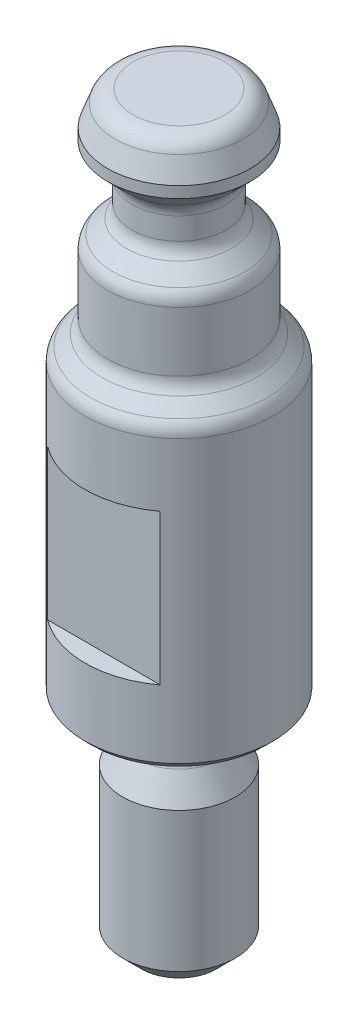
ISO-10303-21;
HEADER;
FILE_DESCRIPTION(('STEP AP214'),'2;1');
FILE_NAME('part.step','',(''),(''),'','','');
FILE_SCHEMA(('AUTOMOTIVE_DESIGN { 1 0 10303 214 1 1 1 1 }'));
ENDSEC;
DATA;
#1=APPLICATION_CONTEXT('core data for automotive mechanical design processes');
#2=APPLICATION_PROTOCOL_DEFINITION('international standard','automotive_design',2000,#1);
#3=PRODUCT_CONTEXT('',#1,'mechanical');
#4=PRODUCT('Part','Part','',(#3));
#5=PRODUCT_RELATED_PRODUCT_CATEGORY('part','',(#4));
#6=PRODUCT_DEFINITION_FORMATION('','',#4);
#7=PRODUCT_DEFINITION_CONTEXT('part definition',#1,'design');
#8=PRODUCT_DEFINITION('design','',#6,#7);
#9=PRODUCT_DEFINITION_SHAPE('','',#8);
#10=(LENGTH_UNIT() NAMED_UNIT(*) SI_UNIT(.MILLI.,.METRE.));
#11=(NAMED_UNIT(*) PLANE_ANGLE_UNIT() SI_UNIT($,.RADIAN.));
#12=(NAMED_UNIT(*) SI_UNIT($,.STERADIAN.) SOLID_ANGLE_UNIT());
#13=UNCERTAINTY_MEASURE_WITH_UNIT(LENGTH_MEASURE(1.E-05),#10,'distance_accuracy_value','');
#14=(GEOMETRIC_REPRESENTATION_CONTEXT(3) GLOBAL_UNCERTAINTY_ASSIGNED_CONTEXT((#13)) GLOBAL_UNIT_ASSIGNED_CONTEXT((#10,
#11,#12)) REPRESENTATION_CONTEXT('',''));
#15=CARTESIAN_POINT('',(0.,0.,0.));
#16=DIRECTION('',(0.,0.,1.));
#17=DIRECTION('',(1.,0.,0.));
#18=AXIS2_PLACEMENT_3D('',#15,#16,#17);
#19=CARTESIAN_POINT('',(0.,0.,0.));
#20=DIRECTION('',(0.,-1.,0.));
#21=DIRECTION('',(0.,0.,-1.));
#22=AXIS2_PLACEMENT_3D('',#19,#20,#21);
#23=CYLINDRICAL_SURFACE('',#22,1.9);
#24=CARTESIAN_POINT('',(0.,13.1,0.));
#25=DIRECTION('',(0.,-1.,0.));
#26=DIRECTION('',(0.,0.,-1.));
#27=AXIS2_PLACEMENT_3D('',#24,#25,#26);
#28=CIRCLE('',#27,1.9);
#29=CARTESIAN_POINT('',(0.,13.1,-1.9));
#30=VERTEX_POINT('',#29);
#31=EDGE_CURVE('E87',#30,#30,#28,.T.);
#32=ORIENTED_EDGE('',*,*,#31,.T.);
#33=EDGE_LOOP('',(#32));
#34=FACE_BOUND('',#33,.T.);
#35=CARTESIAN_POINT('',(0.,12.8,0.));
#36=DIRECTION('',(0.,-1.,0.));
#37=DIRECTION('',(0.,0.,-1.));
#38=AXIS2_PLACEMENT_3D('',#35,#36,#37);
#39=CIRCLE('',#38,1.9);
#40=CARTESIAN_POINT('',(0.,12.8,-1.9));
#41=VERTEX_POINT('',#40);
#42=EDGE_CURVE('E105',#41,#41,#39,.T.);
#43=ORIENTED_EDGE('',*,*,#42,.F.);
#44=EDGE_LOOP('',(#43));
#45=FACE_BOUND('',#44,.T.);
#46=ADVANCED_FACE('F15',(#34,#45),#23,.T.);
#47=CARTESIAN_POINT('',(0.,12.15,0.));
#48=DIRECTION('',(0.,1.,0.));
#49=DIRECTION('',(0.,0.,1.));
#50=AXIS2_PLACEMENT_3D('',#47,#48,#49);
#51=CONICAL_SURFACE('',#50,1.25,0.785398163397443);
#52=CARTESIAN_POINT('',(0.,12.2964466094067,0.));
#53=DIRECTION('',(0.,1.,0.));
#54=DIRECTION('',(0.,0.,1.));
#55=AXIS2_PLACEMENT_3D('',#52,#53,#54);
#56=CIRCLE('',#55,1.39644660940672);
#57=CARTESIAN_POINT('',(0.,12.2964466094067,1.39644660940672));
#58=VERTEX_POINT('',#57);
#59=EDGE_CURVE('E149',#58,#58,#56,.T.);
#60=ORIENTED_EDGE('',*,*,#59,.T.);
#61=EDGE_LOOP('',(#60));
#62=FACE_BOUND('',#61,.T.);
#63=ORIENTED_EDGE('',*,*,#42,.T.);
#64=EDGE_LOOP('',(#63));
#65=FACE_BOUND('',#64,.T.);
#66=ADVANCED_FACE('F209',(#62,#65),#51,.T.);
#67=CARTESIAN_POINT('',(0.,0.,0.));
#68=DIRECTION('',(0.,-1.,0.));
#69=DIRECTION('',(0.,0.,-1.));
#70=AXIS2_PLACEMENT_3D('',#67,#68,#69);
#71=CYLINDRICAL_SURFACE('',#70,1.25);
#72=CARTESIAN_POINT('',(0.,11.9428932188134,0.));
#73=DIRECTION('',(0.,-1.,0.));
#74=DIRECTION('',(0.,0.,-1.));
#75=AXIS2_PLACEMENT_3D('',#72,#73,#74);
#76=CIRCLE('',#75,1.25);
#77=CARTESIAN_POINT('',(0.,11.9428932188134,-1.25));
#78=VERTEX_POINT('',#77);
#79=EDGE_CURVE('E145',#78,#78,#76,.T.);
#80=ORIENTED_EDGE('',*,*,#79,.T.);
#81=EDGE_LOOP('',(#80));
#82=FACE_BOUND('',#81,.T.);
#83=CARTESIAN_POINT('',(0.,11.3571067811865,0.));
#84=DIRECTION('',(0.,-1.,0.));
#85=DIRECTION('',(0.,0.,-1.));
#86=AXIS2_PLACEMENT_3D('',#83,#84,#85);
#87=CIRCLE('',#86,1.25);
#88=CARTESIAN_POINT('',(0.,11.3571067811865,-1.25));
#89=VERTEX_POINT('',#88);
#90=EDGE_CURVE('E141',#89,#89,#87,.F.);
#91=ORIENTED_EDGE('',*,*,#90,.T.);
#92=EDGE_LOOP('',(#91));
#93=FACE_BOUND('',#92,.T.);
#94=ADVANCED_FACE('F215',(#82,#93),#71,.T.);
#95=CARTESIAN_POINT('',(0.,10.5,0.));
#96=DIRECTION('',(0.,-1.,0.));
#97=DIRECTION('',(0.,0.,-1.));
#98=AXIS2_PLACEMENT_3D('',#95,#96,#97);
#99=CONICAL_SURFACE('',#98,1.9,0.785398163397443);
#100=CARTESIAN_POINT('',(0.,11.0035533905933,0.));
#101=DIRECTION('',(0.,-1.,0.));
#102=DIRECTION('',(0.,0.,-1.));
#103=AXIS2_PLACEMENT_3D('',#100,#101,#102);
#104=CIRCLE('',#103,1.39644660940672);
#105=CARTESIAN_POINT('',(0.,11.0035533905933,-1.39644660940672));
#106=VERTEX_POINT('',#105);
#107=EDGE_CURVE('E157',#106,#106,#104,.T.);
#108=ORIENTED_EDGE('',*,*,#107,.T.);
#109=EDGE_LOOP('',(#108));
#110=FACE_BOUND('',#109,.T.);
#111=CARTESIAN_POINT('',(0.,10.6464466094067,0.));
#112=DIRECTION('',(0.,1.,0.));
#113=DIRECTION('',(0.,0.,1.));
#114=AXIS2_PLACEMENT_3D('',#111,#112,#113);
#115=CIRCLE('',#114,1.75355339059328);
#116=CARTESIAN_POINT('',(0.,10.6464466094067,1.75355339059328));
#117=VERTEX_POINT('',#116);
#118=EDGE_CURVE('E153',#117,#117,#115,.T.);
#119=ORIENTED_EDGE('',*,*,#118,.T.);
#120=EDGE_LOOP('',(#119));
#121=FACE_BOUND('',#120,.T.);
#122=ADVANCED_FACE('F264',(#110,#121),#99,.T.);
#123=CARTESIAN_POINT('',(0.,0.,0.));
#124=DIRECTION('',(0.,-1.,0.));
#125=DIRECTION('',(0.,0.,-1.));
#126=AXIS2_PLACEMENT_3D('',#123,#124,#125);
#127=CYLINDRICAL_SURFACE('',#126,1.9);
#128=CARTESIAN_POINT('',(0.,8.70710678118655,0.));
#129=DIRECTION('',(0.,-1.,0.));
#130=DIRECTION('',(0.,0.,-1.));
#131=AXIS2_PLACEMENT_3D('',#128,#129,#130);
#132=CIRCLE('',#131,1.9);
#133=CARTESIAN_POINT('',(0.,8.70710678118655,-1.9));
#134=VERTEX_POINT('',#133);
#135=EDGE_CURVE('E173',#134,#134,#132,.F.);
#136=ORIENTED_EDGE('',*,*,#135,.T.);
#137=EDGE_LOOP('',(#136));
#138=FACE_BOUND('',#137,.T.);
#139=CARTESIAN_POINT('',(0.,10.2928932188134,0.));
#140=DIRECTION('',(0.,1.,0.));
#141=DIRECTION('',(0.,0.,1.));
#142=AXIS2_PLACEMENT_3D('',#139,#140,#141);
#143=CIRCLE('',#142,1.9);
#144=CARTESIAN_POINT('',(0.,10.2928932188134,1.9));
#145=VERTEX_POINT('',#144);
#146=EDGE_CURVE('E169',#145,#145,#143,.F.);
#147=ORIENTED_EDGE('',*,*,#146,.T.);
#148=EDGE_LOOP('',(#147));
#149=FACE_BOUND('',#148,.T.);
#150=ADVANCED_FACE('F261',(#138,#149),#127,.T.);
#151=CARTESIAN_POINT('',(0.,7.9,0.));
#152=DIRECTION('',(0.,-1.,0.));
#153=DIRECTION('',(0.,0.,-1.));
#154=AXIS2_PLACEMENT_3D('',#151,#152,#153);
#155=CONICAL_SURFACE('',#154,2.5,0.785398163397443);
#156=CARTESIAN_POINT('',(0.,8.35355339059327,0.));
#157=DIRECTION('',(0.,-1.,0.));
#158=DIRECTION('',(0.,0.,-1.));
#159=AXIS2_PLACEMENT_3D('',#156,#157,#158);
#160=CIRCLE('',#159,2.04644660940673);
#161=CARTESIAN_POINT('',(0.,8.35355339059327,-2.04644660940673));
#162=VERTEX_POINT('',#161);
#163=EDGE_CURVE('E165',#162,#162,#160,.T.);
#164=ORIENTED_EDGE('',*,*,#163,.T.);
#165=EDGE_LOOP('',(#164));
#166=FACE_BOUND('',#165,.T.);
#167=CARTESIAN_POINT('',(0.,8.04644660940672,0.));
#168=DIRECTION('',(0.,1.,0.));
#169=DIRECTION('',(0.,0.,1.));
#170=AXIS2_PLACEMENT_3D('',#167,#168,#169);
#171=CIRCLE('',#170,2.35355339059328);
#172=CARTESIAN_POINT('',(0.,8.04644660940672,2.35355339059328));
#173=VERTEX_POINT('',#172);
#174=EDGE_CURVE('E161',#173,#173,#171,.T.);
#175=ORIENTED_EDGE('',*,*,#174,.T.);
#176=EDGE_LOOP('',(#175));
#177=FACE_BOUND('',#176,.T.);
#178=ADVANCED_FACE('F263',(#166,#177),#155,.T.);
#179=CARTESIAN_POINT('',(0.,0.,0.));
#180=DIRECTION('',(0.,-1.,0.));
#181=DIRECTION('',(0.,0.,-1.));
#182=AXIS2_PLACEMENT_3D('',#179,#180,#181);
#183=CYLINDRICAL_SURFACE('',#182,2.5);
#184=DIRECTION('',(0.,-1.,0.));
#185=VECTOR('',#184,1.);
#186=CARTESIAN_POINT('',(-1.5,0.,-2.));
#187=LINE('',#186,#185);
#188=CARTESIAN_POINT('',(-1.5,2.,-2.));
#189=VERTEX_POINT('',#188);
#190=CARTESIAN_POINT('',(-1.5,6.,-2.));
#191=VERTEX_POINT('',#190);
#192=EDGE_CURVE('E24',#189,#191,#187,.F.);
#193=ORIENTED_EDGE('',*,*,#192,.F.);
#194=CARTESIAN_POINT('',(0.,2.,0.));
#195=DIRECTION('',(0.,-1.,0.));
#196=DIRECTION('',(0.,0.,-1.));
#197=AXIS2_PLACEMENT_3D('',#194,#195,#196);
#198=CIRCLE('',#197,2.5);
#199=CARTESIAN_POINT('',(1.5,2.,-2.));
#200=VERTEX_POINT('',#199);
#201=EDGE_CURVE('E9',#200,#189,#198,.F.);
#202=ORIENTED_EDGE('',*,*,#201,.F.);
#203=DIRECTION('',(0.,-1.,0.));
#204=VECTOR('',#203,1.);
#205=CARTESIAN_POINT('',(1.5,0.,-2.));
#206=LINE('',#205,#204);
#207=CARTESIAN_POINT('',(1.5,6.,-2.));
#208=VERTEX_POINT('',#207);
#209=EDGE_CURVE('E62',#208,#200,#206,.T.);
#210=ORIENTED_EDGE('',*,*,#209,.F.);
#211=CARTESIAN_POINT('',(0.,6.,0.));
#212=DIRECTION('',(0.,1.,0.));
#213=DIRECTION('',(0.,0.,1.));
#214=AXIS2_PLACEMENT_3D('',#211,#212,#213);
#215=CIRCLE('',#214,2.5);
#216=EDGE_CURVE('E57',#191,#208,#215,.F.);
#217=ORIENTED_EDGE('',*,*,#216,.F.);
#218=EDGE_LOOP('',(#193,#202,#210,#217));
#219=FACE_BOUND('',#218,.T.);
#220=DIRECTION('',(0.,-1.,0.));
#221=VECTOR('',#220,1.);
#222=CARTESIAN_POINT('',(-1.5,0.,2.));
#223=LINE('',#222,#221);
#224=CARTESIAN_POINT('',(-1.5,6.,2.));
#225=VERTEX_POINT('',#224);
#226=CARTESIAN_POINT('',(-1.5,2.,2.));
#227=VERTEX_POINT('',#226);
#228=EDGE_CURVE('E184',#225,#227,#223,.T.);
#229=ORIENTED_EDGE('',*,*,#228,.F.);
#230=CARTESIAN_POINT('',(0.,6.,0.));
#231=DIRECTION('',(0.,1.,0.));
#232=DIRECTION('',(0.,0.,1.));
#233=AXIS2_PLACEMENT_3D('',#230,#231,#232);
#234=CIRCLE('',#233,2.5);
#235=CARTESIAN_POINT('',(1.5,6.,2.));
#236=VERTEX_POINT('',#235);
#237=EDGE_CURVE('E37',#236,#225,#234,.F.);
#238=ORIENTED_EDGE('',*,*,#237,.F.);
#239=DIRECTION('',(0.,-1.,0.));
#240=VECTOR('',#239,1.);
#241=CARTESIAN_POINT('',(1.5,0.,2.));
#242=LINE('',#241,#240);
#243=CARTESIAN_POINT('',(1.5,2.,2.));
#244=VERTEX_POINT('',#243);
#245=EDGE_CURVE('E31',#244,#236,#242,.F.);
#246=ORIENTED_EDGE('',*,*,#245,.F.);
#247=CARTESIAN_POINT('',(0.,2.,0.));
#248=DIRECTION('',(0.,-1.,0.));
#249=DIRECTION('',(0.,0.,-1.));
#250=AXIS2_PLACEMENT_3D('',#247,#248,#249);
#251=CIRCLE('',#250,2.5);
#252=EDGE_CURVE('E181',#227,#244,#251,.F.);
#253=ORIENTED_EDGE('',*,*,#252,.F.);
#254=EDGE_LOOP('',(#229,#238,#246,#253));
#255=FACE_BOUND('',#254,.T.);
#256=CARTESIAN_POINT('',(0.,7.69289321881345,0.));
#257=DIRECTION('',(0.,1.,0.));
#258=DIRECTION('',(0.,0.,1.));
#259=AXIS2_PLACEMENT_3D('',#256,#257,#258);
#260=CIRCLE('',#259,2.5);
#261=CARTESIAN_POINT('',(0.,7.69289321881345,2.5));
#262=VERTEX_POINT('',#261);
#263=EDGE_CURVE('E177',#262,#262,#260,.F.);
#264=ORIENTED_EDGE('',*,*,#263,.T.);
#265=EDGE_LOOP('',(#264));
#266=FACE_BOUND('',#265,.T.);
#267=CARTESIAN_POINT('',(0.,0.2,0.));
#268=DIRECTION('',(0.,-1.,0.));
#269=DIRECTION('',(0.,0.,-1.));
#270=AXIS2_PLACEMENT_3D('',#267,#268,#269);
#271=CIRCLE('',#270,2.5);
#272=CARTESIAN_POINT('',(0.,0.2,-2.5));
#273=VERTEX_POINT('',#272);
#274=EDGE_CURVE('E121',#273,#273,#271,.F.);
#275=ORIENTED_EDGE('',*,*,#274,.T.);
#276=EDGE_LOOP('',(#275));
#277=FACE_BOUND('',#276,.T.);
#278=ADVANCED_FACE('F59',(#219,#255,#266,#277),#183,.T.);
#279=CARTESIAN_POINT('',(2.5,0.,0.));
#280=DIRECTION('',(0.,-1.,0.));
#281=DIRECTION('',(0.,0.,-1.));
#282=AXIS2_PLACEMENT_3D('',#279,#280,#281);
#283=PLANE('',#282);
#284=CARTESIAN_POINT('',(0.,0.,0.));
#285=DIRECTION('',(0.,-1.,0.));
#286=DIRECTION('',(0.,0.,-1.));
#287=AXIS2_PLACEMENT_3D('',#284,#285,#286);
#288=CIRCLE('',#287,1.5);
#289=CARTESIAN_POINT('',(0.,0.,-1.5));
#290=VERTEX_POINT('',#289);
#291=EDGE_CURVE('E137',#290,#290,#288,.F.);
#292=ORIENTED_EDGE('',*,*,#291,.T.);
#293=EDGE_LOOP('',(#292));
#294=FACE_BOUND('',#293,.T.);
#295=CARTESIAN_POINT('',(0.,0.,0.));
#296=DIRECTION('',(0.,-1.,0.));
#297=DIRECTION('',(0.,0.,-1.));
#298=AXIS2_PLACEMENT_3D('',#295,#296,#297);
#299=CIRCLE('',#298,2.3);
#300=CARTESIAN_POINT('',(0.,0.,-2.3));
#301=VERTEX_POINT('',#300);
#302=EDGE_CURVE('E117',#301,#301,#299,.T.);
#303=ORIENTED_EDGE('',*,*,#302,.T.);
#304=EDGE_LOOP('',(#303));
#305=FACE_BOUND('',#304,.T.);
#306=ADVANCED_FACE('F320',(#294,#305),#283,.T.);
#307=CARTESIAN_POINT('',(0.,0.,0.));
#308=DIRECTION('',(0.,-1.,0.));
#309=DIRECTION('',(0.,0.,-1.));
#310=AXIS2_PLACEMENT_3D('',#307,#308,#309);
#311=CYLINDRICAL_SURFACE('',#310,1.1);
#312=CARTESIAN_POINT('',(0.,-0.703968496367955,0.));
#313=DIRECTION('',(0.,-1.,0.));
#314=DIRECTION('',(0.,0.,-1.));
#315=AXIS2_PLACEMENT_3D('',#312,#313,#314);
#316=CIRCLE('',#315,1.1);
#317=CARTESIAN_POINT('',(0.,-0.703968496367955,-1.1));
#318=VERTEX_POINT('',#317);
#319=EDGE_CURVE('E133',#318,#318,#316,.F.);
#320=ORIENTED_EDGE('',*,*,#319,.T.);
#321=EDGE_LOOP('',(#320));
#322=FACE_BOUND('',#321,.T.);
#323=CARTESIAN_POINT('',(0.,-0.4,0.));
#324=DIRECTION('',(0.,-1.,0.));
#325=DIRECTION('',(0.,0.,-1.));
#326=AXIS2_PLACEMENT_3D('',#323,#324,#325);
#327=CIRCLE('',#326,1.1);
#328=CARTESIAN_POINT('',(0.,-0.4,-1.1));
#329=VERTEX_POINT('',#328);
#330=EDGE_CURVE('E129',#329,#329,#327,.T.);
#331=ORIENTED_EDGE('',*,*,#330,.T.);
#332=EDGE_LOOP('',(#331));
#333=FACE_BOUND('',#332,.T.);
#334=ADVANCED_FACE('F329',(#322,#333),#311,.T.);
#335=CARTESIAN_POINT('',(0.,-1.58504420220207,0.));
#336=DIRECTION('',(0.,-1.,0.));
#337=DIRECTION('',(0.,0.,-1.));
#338=AXIS2_PLACEMENT_3D('',#335,#336,#337);
#339=CONICAL_SURFACE('',#338,1.5,0.471238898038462);
#340=CARTESIAN_POINT('',(0.,-0.885564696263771,0.));
#341=DIRECTION('',(0.,-1.,0.));
#342=DIRECTION('',(0.,0.,-1.));
#343=AXIS2_PLACEMENT_3D('',#340,#341,#342);
#344=CIRCLE('',#343,1.14359739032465);
#345=CARTESIAN_POINT('',(0.,-0.885564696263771,-1.14359739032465));
#346=VERTEX_POINT('',#345);
#347=EDGE_CURVE('E125',#346,#346,#344,.T.);
#348=ORIENTED_EDGE('',*,*,#347,.T.);
#349=EDGE_LOOP('',(#348));
#350=FACE_BOUND('',#349,.T.);
#351=CARTESIAN_POINT('',(0.,-1.58504420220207,0.));
#352=DIRECTION('',(0.,-1.,0.));
#353=DIRECTION('',(0.,0.,-1.));
#354=AXIS2_PLACEMENT_3D('',#351,#352,#353);
#355=CIRCLE('',#354,1.5);
#356=CARTESIAN_POINT('',(0.,-1.58504420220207,-1.5));
#357=VERTEX_POINT('',#356);
#358=EDGE_CURVE('E101',#357,#357,#355,.T.);
#359=ORIENTED_EDGE('',*,*,#358,.F.);
#360=EDGE_LOOP('',(#359));
#361=FACE_BOUND('',#360,.T.);
#362=ADVANCED_FACE('F339',(#350,#361),#339,.T.);
#363=CARTESIAN_POINT('',(0.,0.,0.));
#364=DIRECTION('',(0.,-1.,0.));
#365=DIRECTION('',(0.,0.,-1.));
#366=AXIS2_PLACEMENT_3D('',#363,#364,#365);
#367=CYLINDRICAL_SURFACE('',#366,1.5);
#368=ORIENTED_EDGE('',*,*,#358,.T.);
#369=EDGE_LOOP('',(#368));
#370=FACE_BOUND('',#369,.T.);
#371=CARTESIAN_POINT('',(0.,-5.3,0.));
#372=DIRECTION('',(0.,-1.,0.));
#373=DIRECTION('',(0.,0.,-1.));
#374=AXIS2_PLACEMENT_3D('',#371,#372,#373);
#375=CIRCLE('',#374,1.5);
#376=CARTESIAN_POINT('',(0.,-5.3,-1.5));
#377=VERTEX_POINT('',#376);
#378=EDGE_CURVE('E97',#377,#377,#375,.T.);
#379=ORIENTED_EDGE('',*,*,#378,.F.);
#380=EDGE_LOOP('',(#379));
#381=FACE_BOUND('',#380,.T.);
#382=ADVANCED_FACE('F349',(#370,#381),#367,.T.);
#383=CARTESIAN_POINT('',(0.,-5.8,0.));
#384=DIRECTION('',(0.,1.,0.));
#385=DIRECTION('',(0.,0.,1.));
#386=AXIS2_PLACEMENT_3D('',#383,#384,#385);
#387=CONICAL_SURFACE('',#386,1.,0.785398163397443);
#388=ORIENTED_EDGE('',*,*,#378,.T.);
#389=EDGE_LOOP('',(#388));
#390=FACE_BOUND('',#389,.T.);
#391=CARTESIAN_POINT('',(0.,-5.8,0.));
#392=DIRECTION('',(0.,-1.,0.));
#393=DIRECTION('',(0.,0.,-1.));
#394=AXIS2_PLACEMENT_3D('',#391,#392,#393);
#395=CIRCLE('',#394,1.);
#396=CARTESIAN_POINT('',(0.,-5.8,-1.));
#397=VERTEX_POINT('',#396);
#398=EDGE_CURVE('E93',#397,#397,#395,.T.);
#399=ORIENTED_EDGE('',*,*,#398,.F.);
#400=EDGE_LOOP('',(#399));
#401=FACE_BOUND('',#400,.T.);
#402=ADVANCED_FACE('F360',(#390,#401),#387,.T.);
#403=CARTESIAN_POINT('',(1.,-5.8,0.));
#404=DIRECTION('',(0.,-1.,0.));
#405=DIRECTION('',(0.,0.,-1.));
#406=AXIS2_PLACEMENT_3D('',#403,#404,#405);
#407=PLANE('',#406);
#408=ORIENTED_EDGE('',*,*,#398,.T.);
#409=EDGE_LOOP('',(#408));
#410=FACE_BOUND('',#409,.T.);
#411=ADVANCED_FACE('F372',(#410),#407,.T.);
#412=CARTESIAN_POINT('',(0.,14.,0.));
#413=DIRECTION('',(0.,1.,0.));
#414=DIRECTION('',(0.,0.,1.));
#415=AXIS2_PLACEMENT_3D('',#412,#413,#414);
#416=PLANE('',#415);
#417=CARTESIAN_POINT('',(0.,14.,0.));
#418=DIRECTION('',(0.,1.,0.));
#419=DIRECTION('',(0.,0.,1.));
#420=AXIS2_PLACEMENT_3D('',#417,#418,#419);
#421=CIRCLE('',#420,1.22232302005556);
#422=CARTESIAN_POINT('',(0.,14.,1.22232302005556));
#423=VERTEX_POINT('',#422);
#424=EDGE_CURVE('E113',#423,#423,#421,.T.);
#425=ORIENTED_EDGE('',*,*,#424,.T.);
#426=EDGE_LOOP('',(#425));
#427=FACE_BOUND('',#426,.T.);
#428=ADVANCED_FACE('F382',(#427),#416,.T.);
#429=CARTESIAN_POINT('',(0.,13.1,0.));
#430=DIRECTION('',(0.,-1.,0.));
#431=DIRECTION('',(0.,0.,-1.));
#432=AXIS2_PLACEMENT_3D('',#429,#430,#431);
#433=CONICAL_SURFACE('',#432,1.9,0.349065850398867);
#434=CARTESIAN_POINT('',(0.,13.6710100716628,0.));
#435=DIRECTION('',(0.,1.,0.));
#436=DIRECTION('',(0.,0.,1.));
#437=AXIS2_PLACEMENT_3D('',#434,#435,#436);
#438=CIRCLE('',#437,1.69216933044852);
#439=CARTESIAN_POINT('',(0.,13.6710100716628,1.69216933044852));
#440=VERTEX_POINT('',#439);
#441=EDGE_CURVE('E109',#440,#440,#438,.F.);
#442=ORIENTED_EDGE('',*,*,#441,.T.);
#443=EDGE_LOOP('',(#442));
#444=FACE_BOUND('',#443,.T.);
#445=ORIENTED_EDGE('',*,*,#31,.F.);
#446=EDGE_LOOP('',(#445));
#447=FACE_BOUND('',#446,.T.);
#448=ADVANCED_FACE('F225',(#444,#447),#433,.T.);
#449=CARTESIAN_POINT('',(0.,13.5,0.));
#450=DIRECTION('',(0.,1.,0.));
#451=DIRECTION('',(0.,0.,1.));
#452=AXIS2_PLACEMENT_3D('',#449,#450,#451);
#453=TOROIDAL_SURFACE('',#452,1.22232302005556,0.5);
#454=ORIENTED_EDGE('',*,*,#424,.F.);
#455=EDGE_LOOP('',(#454));
#456=FACE_BOUND('',#455,.T.);
#457=ORIENTED_EDGE('',*,*,#441,.F.);
#458=EDGE_LOOP('',(#457));
#459=FACE_BOUND('',#458,.T.);
#460=ADVANCED_FACE('F221',(#456,#459),#453,.T.);
#461=CARTESIAN_POINT('',(0.,0.,0.));
#462=DIRECTION('',(0.,1.,0.));
#463=DIRECTION('',(0.,0.,1.));
#464=AXIS2_PLACEMENT_3D('',#461,#462,#463);
#465=CONICAL_SURFACE('',#464,2.3,0.785398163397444);
#466=ORIENTED_EDGE('',*,*,#274,.F.);
#467=EDGE_LOOP('',(#466));
#468=FACE_BOUND('',#467,.T.);
#469=ORIENTED_EDGE('',*,*,#302,.F.);
#470=EDGE_LOOP('',(#469));
#471=FACE_BOUND('',#470,.T.);
#472=ADVANCED_FACE('F224',(#468,#471),#465,.T.);
#473=CARTESIAN_POINT('',(0.,-0.703968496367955,0.));
#474=DIRECTION('',(0.,-1.,0.));
#475=DIRECTION('',(0.,0.,-1.));
#476=AXIS2_PLACEMENT_3D('',#473,#474,#475);
#477=TOROIDAL_SURFACE('',#476,1.5,0.4);
#478=ORIENTED_EDGE('',*,*,#319,.F.);
#479=EDGE_LOOP('',(#478));
#480=FACE_BOUND('',#479,.T.);
#481=ORIENTED_EDGE('',*,*,#347,.F.);
#482=EDGE_LOOP('',(#481));
#483=FACE_BOUND('',#482,.T.);
#484=ADVANCED_FACE('F229',(#480,#483),#477,.F.);
#485=CARTESIAN_POINT('',(0.,-0.4,0.));
#486=DIRECTION('',(0.,-1.,0.));
#487=DIRECTION('',(0.,0.,-1.));
#488=AXIS2_PLACEMENT_3D('',#485,#486,#487);
#489=TOROIDAL_SURFACE('',#488,1.5,0.4);
#490=ORIENTED_EDGE('',*,*,#291,.F.);
#491=EDGE_LOOP('',(#490));
#492=FACE_BOUND('',#491,.T.);
#493=ORIENTED_EDGE('',*,*,#330,.F.);
#494=EDGE_LOOP('',(#493));
#495=FACE_BOUND('',#494,.T.);
#496=ADVANCED_FACE('F233',(#492,#495),#489,.F.);
#497=CARTESIAN_POINT('',(0.,11.9428932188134,0.));
#498=DIRECTION('',(0.,-1.,0.));
#499=DIRECTION('',(0.,0.,-1.));
#500=AXIS2_PLACEMENT_3D('',#497,#498,#499);
#501=TOROIDAL_SURFACE('',#500,1.75,0.5);
#502=ORIENTED_EDGE('',*,*,#59,.F.);
#503=EDGE_LOOP('',(#502));
#504=FACE_BOUND('',#503,.T.);
#505=ORIENTED_EDGE('',*,*,#79,.F.);
#506=EDGE_LOOP('',(#505));
#507=FACE_BOUND('',#506,.T.);
#508=ADVANCED_FACE('F237',(#504,#507),#501,.F.);
#509=CARTESIAN_POINT('',(0.,11.3571067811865,0.));
#510=DIRECTION('',(0.,-1.,0.));
#511=DIRECTION('',(0.,0.,-1.));
#512=AXIS2_PLACEMENT_3D('',#509,#510,#511);
#513=TOROIDAL_SURFACE('',#512,1.75,0.5);
#514=ORIENTED_EDGE('',*,*,#90,.F.);
#515=EDGE_LOOP('',(#514));
#516=FACE_BOUND('',#515,.T.);
#517=ORIENTED_EDGE('',*,*,#107,.F.);
#518=EDGE_LOOP('',(#517));
#519=FACE_BOUND('',#518,.T.);
#520=ADVANCED_FACE('F241',(#516,#519),#513,.F.);
#521=CARTESIAN_POINT('',(0.,8.70710678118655,0.));
#522=DIRECTION('',(0.,-1.,0.));
#523=DIRECTION('',(0.,0.,-1.));
#524=AXIS2_PLACEMENT_3D('',#521,#522,#523);
#525=TOROIDAL_SURFACE('',#524,2.4,0.5);
#526=ORIENTED_EDGE('',*,*,#135,.F.);
#527=EDGE_LOOP('',(#526));
#528=FACE_BOUND('',#527,.T.);
#529=ORIENTED_EDGE('',*,*,#163,.F.);
#530=EDGE_LOOP('',(#529));
#531=FACE_BOUND('',#530,.T.);
#532=ADVANCED_FACE('F245',(#528,#531),#525,.F.);
#533=CARTESIAN_POINT('',(0.,10.2928932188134,0.));
#534=DIRECTION('',(0.,1.,0.));
#535=DIRECTION('',(0.,0.,1.));
#536=AXIS2_PLACEMENT_3D('',#533,#534,#535);
#537=TOROIDAL_SURFACE('',#536,1.4,0.5);
#538=ORIENTED_EDGE('',*,*,#118,.F.);
#539=EDGE_LOOP('',(#538));
#540=FACE_BOUND('',#539,.T.);
#541=ORIENTED_EDGE('',*,*,#146,.F.);
#542=EDGE_LOOP('',(#541));
#543=FACE_BOUND('',#542,.T.);
#544=ADVANCED_FACE('F248',(#540,#543),#537,.T.);
#545=CARTESIAN_POINT('',(0.,7.69289321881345,0.));
#546=DIRECTION('',(0.,1.,0.));
#547=DIRECTION('',(0.,0.,1.));
#548=AXIS2_PLACEMENT_3D('',#545,#546,#547);
#549=TOROIDAL_SURFACE('',#548,2.,0.5);
#550=ORIENTED_EDGE('',*,*,#174,.F.);
#551=EDGE_LOOP('',(#550));
#552=FACE_BOUND('',#551,.T.);
#553=ORIENTED_EDGE('',*,*,#263,.F.);
#554=EDGE_LOOP('',(#553));
#555=FACE_BOUND('',#554,.T.);
#556=ADVANCED_FACE('F17',(#552,#555),#549,.T.);
#557=CARTESIAN_POINT('',(-2.5,6.,2.5));
#558=DIRECTION('',(0.,1.,0.));
#559=DIRECTION('',(0.,0.,1.));
#560=AXIS2_PLACEMENT_3D('',#557,#558,#559);
#561=PLANE('',#560);
#562=ORIENTED_EDGE('',*,*,#237,.T.);
#563=DIRECTION('',(1.,0.,0.));
#564=VECTOR('',#563,1.);
#565=CARTESIAN_POINT('',(-2.5,6.,2.));
#566=LINE('',#565,#564);
#567=EDGE_CURVE('E84',#225,#236,#566,.T.);
#568=ORIENTED_EDGE('',*,*,#567,.T.);
#569=EDGE_LOOP('',(#562,#568));
#570=FACE_BOUND('',#569,.T.);
#571=ADVANCED_FACE('F255',(#570),#561,.F.);
#572=CARTESIAN_POINT('',(-2.5,6.,2.));
#573=DIRECTION('',(0.,0.,-1.));
#574=DIRECTION('',(0.,1.,0.));
#575=AXIS2_PLACEMENT_3D('',#572,#573,#574);
#576=PLANE('',#575);
#577=ORIENTED_EDGE('',*,*,#245,.T.);
#578=ORIENTED_EDGE('',*,*,#567,.F.);
#579=ORIENTED_EDGE('',*,*,#228,.T.);
#580=DIRECTION('',(1.,0.,0.));
#581=VECTOR('',#580,1.);
#582=CARTESIAN_POINT('',(-2.5,2.,2.));
#583=LINE('',#582,#581);
#584=EDGE_CURVE('E81',#227,#244,#583,.T.);
#585=ORIENTED_EDGE('',*,*,#584,.T.);
#586=EDGE_LOOP('',(#577,#578,#579,#585));
#587=FACE_BOUND('',#586,.T.);
#588=ADVANCED_FACE('F205',(#587),#576,.F.);
#589=CARTESIAN_POINT('',(-2.5,2.,2.5));
#590=DIRECTION('',(0.,-1.,0.));
#591=DIRECTION('',(0.,0.,-1.));
#592=AXIS2_PLACEMENT_3D('',#589,#590,#591);
#593=PLANE('',#592);
#594=ORIENTED_EDGE('',*,*,#584,.F.);
#595=ORIENTED_EDGE('',*,*,#252,.T.);
#596=EDGE_LOOP('',(#594,#595));
#597=FACE_BOUND('',#596,.T.);
#598=ADVANCED_FACE('F197',(#597),#593,.F.);
#599=CARTESIAN_POINT('',(-2.5,2.,-2.5));
#600=DIRECTION('',(0.,-1.,0.));
#601=DIRECTION('',(0.,0.,-1.));
#602=AXIS2_PLACEMENT_3D('',#599,#600,#601);
#603=PLANE('',#602);
#604=ORIENTED_EDGE('',*,*,#201,.T.);
#605=DIRECTION('',(1.,0.,0.));
#606=VECTOR('',#605,1.);
#607=CARTESIAN_POINT('',(-2.5,2.,-2.));
#608=LINE('',#607,#606);
#609=EDGE_CURVE('E73',#189,#200,#608,.T.);
#610=ORIENTED_EDGE('',*,*,#609,.T.);
#611=EDGE_LOOP('',(#604,#610));
#612=FACE_BOUND('',#611,.T.);
#613=ADVANCED_FACE('F195',(#612),#603,.F.);
#614=CARTESIAN_POINT('',(-2.5,6.,-2.));
#615=DIRECTION('',(0.,0.,1.));
#616=DIRECTION('',(0.,-1.,0.));
#617=AXIS2_PLACEMENT_3D('',#614,#615,#616);
#618=PLANE('',#617);
#619=ORIENTED_EDGE('',*,*,#192,.T.);
#620=DIRECTION('',(1.,0.,0.));
#621=VECTOR('',#620,1.);
#622=CARTESIAN_POINT('',(-2.5,6.,-2.));
#623=LINE('',#622,#621);
#624=EDGE_CURVE('E71',#191,#208,#623,.T.);
#625=ORIENTED_EDGE('',*,*,#624,.T.);
#626=ORIENTED_EDGE('',*,*,#209,.T.);
#627=ORIENTED_EDGE('',*,*,#609,.F.);
#628=EDGE_LOOP('',(#619,#625,#626,#627));
#629=FACE_BOUND('',#628,.T.);
#630=ADVANCED_FACE('F70',(#629),#618,.F.);
#631=CARTESIAN_POINT('',(-2.5,6.,-2.5));
#632=DIRECTION('',(0.,1.,0.));
#633=DIRECTION('',(0.,0.,1.));
#634=AXIS2_PLACEMENT_3D('',#631,#632,#633);
#635=PLANE('',#634);
#636=ORIENTED_EDGE('',*,*,#624,.F.);
#637=ORIENTED_EDGE('',*,*,#216,.T.);
#638=EDGE_LOOP('',(#636,#637));
#639=FACE_BOUND('',#638,.T.);
#640=ADVANCED_FACE('F75',(#639),#635,.F.);
#641=CLOSED_SHELL('',(#46,#66,#94,#122,#150,#178,#278,#306,#334,#362,#382,#402,#411,#428,#448,
#460,#472,#484,#496,#508,#520,#532,#544,#556,#571,#588,#598,#613,#630,#640));
#642=MANIFOLD_SOLID_BREP('B1',#641);
#643=ADVANCED_BREP_SHAPE_REPRESENTATION('',(#18,#642),#14);
#644=SHAPE_DEFINITION_REPRESENTATION(#9,#643);
ENDSEC;
END-ISO-10303-21;
